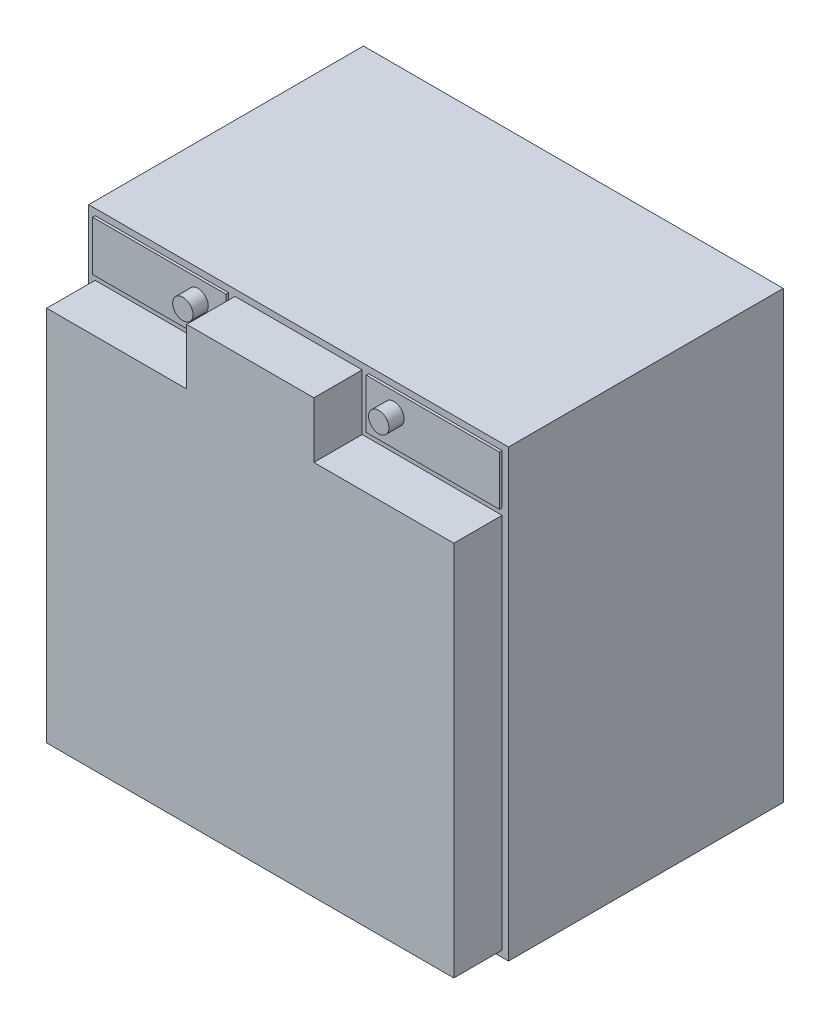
from build123d import *

# Parameters (mm, degrees)
ESQUISSE1_W      = 165
ESQUISSE1_H      = 108
EXTRUSION1_DEPTH = 175
EXTRUSION2_DEPTH = 19
ESQUISSE4_W      = 52.5
ESQUISSE4_H      = 19.5
EXTRUSION3_DEPTH = 1
ESQUISSE5_W      = 52.42
ESQUISSE5_H      = 19.5
EXTRUSION4_DEPTH = 1
ESQUISSE6_R      = 4
EXTRUSION5_DEPTH = 6


with BuildPart() as part:
    # Esquisse1 → Extrusion1 (new body)
    with BuildSketch(Plane(origin=(0, 0, 0), x_dir=(1, 0, 0), z_dir=(0, 1, 0))):
        with Locations((82.5, 54)):
            Rectangle(ESQUISSE1_W, ESQUISSE1_H)
    extrude(amount=EXTRUSION1_DEPTH)

    # Esquisse2 → Extrusion2 (add)
    with BuildSketch(Plane.XY):
        Polygon((2.5, 150.5), (2.5, 2.5), (162.5, 2.5), (162.5, 150.5), (107.5, 150.5), (107.5, 172.5), (57.5, 172.5), (57.5, 150.5), align=None)
    extrude(amount=EXTRUSION2_DEPTH)

    # Esquisse4 → Extrusion3 (add)
    with BuildSketch(Plane.XY):
        with Locations((28.75, 162.75)):
            Rectangle(ESQUISSE4_W, ESQUISSE4_H)
    extrude(amount=EXTRUSION3_DEPTH)

    # Esquisse5 → Extrusion4 (add)
    with BuildSketch(Plane.XY):
        with Locations((136.29, 162.75)):
            Rectangle(ESQUISSE5_W, ESQUISSE5_H)
    extrude(amount=EXTRUSION4_DEPTH)

    # Esquisse6 → Extrusion5 (add)
    with BuildSketch(Plane.XY.offset(1)):
        with Locations((44, 165)):
            Circle(ESQUISSE6_R)
        with Locations((121, 165)):
            Circle(ESQUISSE6_R)
    extrude(amount=EXTRUSION5_DEPTH)


solid = part.part
